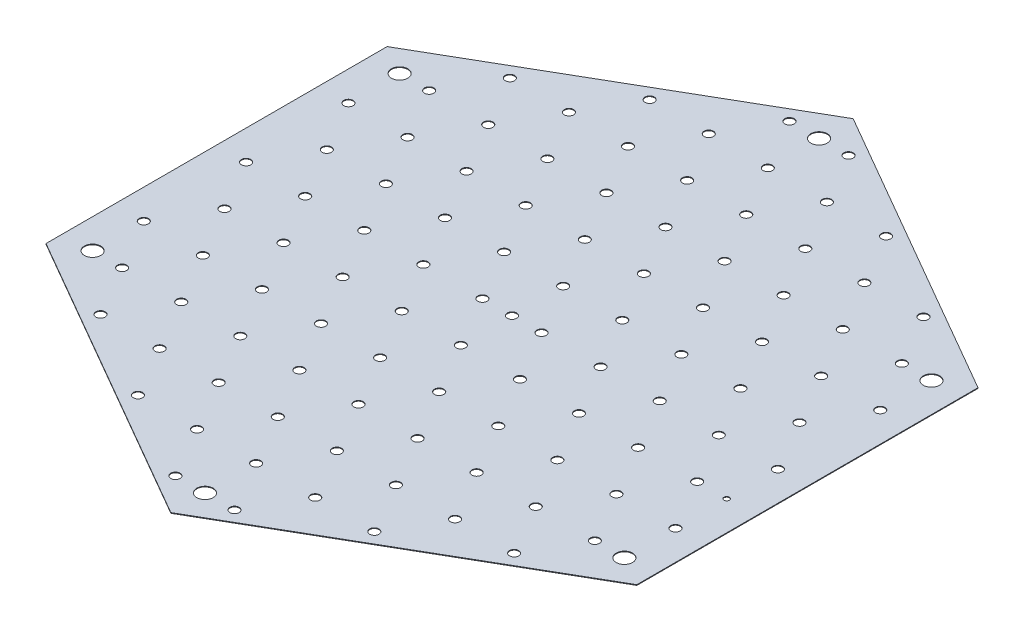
from build123d import *

# Parameters (mm, degrees)
BOSS_EXTRUDE1_DEPTH   = 0.12
SKETCH2_R             = 0.85
CUT_EXTRUDE1_DEPTH    = 83.679815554
BOSS_EXTRUDE2_DEPTH   = 0.12
BOSS_EXTRUDE3_DEPTH   = 0.12
BOSS_EXTRUDE4_DEPTH   = 0.12
SKETCH4_R             = 1.5
CUT_EXTRUDE3_DEPTH    = 83.679815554
SKETCH8_R             = 0.85
CUT_EXTRUDE4_DEPTH    = 83.679815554
SKETCH9_R             = 0.85
CUT_EXTRUDE5_DEPTH    = 83.679815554
SKETCH10_R            = 0.85
CUT_EXTRUDE6_DEPTH    = 83.679815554
SKETCH11_R            = 0.85
CUT_EXTRUDE7_DEPTH    = 83.679815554
SKETCH12_R            = 0.85
CUT_EXTRUDE8_DEPTH    = 83.679815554
SKETCH13_R            = 0.85
CUT_EXTRUDE9_DEPTH    = 83.679815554
SKETCH14_R            = 0.85
CUT_EXTRUDE10_DEPTH   = 83.679815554
SKETCH15_R            = 0.85
CUT_EXTRUDE11_DEPTH   = 83.679815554
SKETCH16_R            = 0.85
CUT_EXTRUDE12_DEPTH   = 83.679815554
SKETCH17_R            = 0.85
CUT_EXTRUDE13_DEPTH   = 83.679815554
LPATTERN3_COUNT       = 5
LPATTERN3_PITCH       = 10.8253
LPATTERN3_COL_COUNT   = 6
LPATTERN3_COL_PITCH   = 10.8253
LPATTERN4_COUNT       = 6
LPATTERN4_PITCH       = 10.8253
LPATTERN4_COL_COUNT   = 5
LPATTERN4_COL_PITCH   = 10.8253
LPATTERN5_COUNT       = 4
LPATTERN5_PITCH       = 10.8253
LPATTERN5_COL_COUNT   = 7
LPATTERN5_COL_PITCH   = 10.8253
LPATTERN6_COUNT       = 3
LPATTERN6_PITCH       = 10.8253
LPATTERN6_COL_COUNT   = 7
LPATTERN6_COL_PITCH   = 10.8253
LPATTERN7_COUNT       = 6
LPATTERN7_PITCH       = 10.8253
LPATTERN8_COUNT       = 5
LPATTERN8_PITCH       = 10.8253
LPATTERN9_COUNT       = 5
LPATTERN9_PITCH       = 10.8253
LPATTERN9_COL_COUNT   = 2
LPATTERN9_COL_PITCH   = 10.8253
LPATTERN10_COUNT      = 4
LPATTERN10_PITCH      = 10.8253
LPATTERN10_COL_COUNT  = 3
LPATTERN10_COL_PITCH  = 10.8253
LPATTERN11_COUNT      = 4
LPATTERN11_PITCH      = 10.8253
LPATTERN11_COL_COUNT  = 3
LPATTERN11_COL_PITCH  = 10.8253
LPATTERN12_COUNT      = 5
LPATTERN12_PITCH      = 10.8253
LPATTERN13_COUNT      = 6
LPATTERN13_PITCH      = 10.8253
LPATTERN14_COUNT      = 6
LPATTERN14_PITCH      = 10.8253
LPATTERN14_COUNT_DIR2 = 5
LPATTERN14_PITCH_DIR2 = 10.8253
LPATTERN15_COUNT      = 7
LPATTERN15_PITCH      = 10.8253
LPATTERN15_COUNT_DIR2 = 4
LPATTERN15_PITCH_DIR2 = 10.8253
LPATTERN16_COUNT      = 7
LPATTERN16_PITCH      = 10.8253
LPATTERN16_COUNT_DIR2 = 3
LPATTERN16_PITCH_DIR2 = 10.8253
LPATTERN17_COUNT      = 6
LPATTERN17_PITCH      = 10.8253
LPATTERN18_COUNT      = 5
LPATTERN18_PITCH      = 10.8253
LPATTERN19_COUNT      = 4
LPATTERN19_PITCH      = 10.8253
LPATTERN20_COUNT      = 3
LPATTERN20_PITCH      = 10.8253
SKETCH18_R            = 0.5
CUT_EXTRUDE14_DEPTH   = 83.679815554


with BuildPart() as part:
    # Sketch1 → Boss-Extrude1 (new body)
    with BuildSketch(Plane(origin=(0, 0, 0), x_dir=(1, 0, 0), z_dir=(0, 1, 0))):
        Polygon((0, 62.5), (-54.126587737, 31.25), (-54.126587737, -31.25), (0, -62.5), (54.126587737, -31.25), (54.126587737, 31.25), align=None)
    extrude(amount=BOSS_EXTRUDE1_DEPTH)

    # Sketch2 → Cut-Extrude1 (cut, through all)
    with BuildSketch(Plane(origin=(0, 0.12, 0), x_dir=(1, 0, 0), z_dir=(0, 1, 0))):
        with Locations(Location((0, 0, 0), (0, 0, 270))):
            Circle(SKETCH2_R)
    extrude(amount=-CUT_EXTRUDE1_DEPTH, mode=Mode.SUBTRACT)

    # Sketch5 → Boss-Extrude2 (add)
    with BuildSketch(Plane(origin=(0, 0.12, 0), x_dir=(1, 0, 0), z_dir=(0, 1, 0))):
        Polygon((-54.126587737, 26.862137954), (3.8, 60.306068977), (0, 62.5), (-54.126587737, 31.25), align=None)
    extrude(amount=-BOSS_EXTRUDE2_DEPTH)

    # Sketch6 → Boss-Extrude3 (add)
    with BuildSketch(Plane(origin=(0, 0.12, 0), x_dir=(1, 0, 0), z_dir=(0, 1, 0))):
        Polygon((54.126587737, 31.25), (54.126587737, 26.862137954), (-3.8, 60.306068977), (0, 62.5), align=None)
    extrude(amount=-BOSS_EXTRUDE3_DEPTH)

    # Sketch7 → Boss-Extrude4 (add)
    with BuildSketch(Plane(origin=(0, 0.12, 0), x_dir=(1, 0, 0), z_dir=(0, 1, 0))):
        Polygon((-54.126587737, -31.25), (-54.126587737, -26.862137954), (0, -58.112137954), (54.126587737, -26.862137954), (54.126587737, -31.25), (0, -62.5), align=None)
    extrude(amount=-BOSS_EXTRUDE4_DEPTH)

    # Sketch4 → Cut-Extrude3 (cut, through all)
    with BuildSketch(Plane(origin=(0, 0.12, 0), x_dir=(1, 0, 0), z_dir=(0, 1, 0))):
        with Locations(Location((0, 56.253070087, 0), (0, 0, 270))):
            Circle(SKETCH4_R)
        with Locations(Location((-48.713928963, 28.125, 0), (0, 0, 270))):
            Circle(SKETCH4_R)
        with Locations(Location((-48.716587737, -28.126535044, 0), (0, 0, 270))):
            Circle(SKETCH4_R)
        with Locations(Location((0, -56.253070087, 0), (0, 0, 270))):
            Circle(SKETCH4_R)
        with Locations(Location((48.716587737, -28.126535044, 0), (0, 0, 270))):
            Circle(SKETCH4_R)
        with Locations(Location((48.716587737, 28.126535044, 0), (0, 0, 270))):
            Circle(SKETCH4_R)
    extrude(amount=-CUT_EXTRUDE3_DEPTH, mode=Mode.SUBTRACT)

    # Sketch8 → Cut-Extrude4 (cut, through all)
    with BuildSketch(Plane(origin=(0, 0.12, 0), x_dir=(1, 0, 0), z_dir=(0, 1, 0))):
        with Locations(Location((5.41265, 0, 0), (0, 0, 270))):
            Circle(SKETCH8_R)
    cut_extrude4 = extrude(amount=-CUT_EXTRUDE4_DEPTH, mode=Mode.SUBTRACT)

    # Sketch9 → Cut-Extrude5 (cut, through all)
    with BuildSketch(Plane(origin=(0, 0.12, 0), x_dir=(1, 0, 0), z_dir=(0, 1, 0))):
        with Locations(Location((16.23795, 0, 0), (0, 0, 270))):
            Circle(SKETCH9_R)
    cut_extrude5 = extrude(amount=-CUT_EXTRUDE5_DEPTH, mode=Mode.SUBTRACT)

    # Sketch10 → Cut-Extrude6 (cut, through all)
    with BuildSketch(Plane(origin=(0, 0.12, 0), x_dir=(1, 0, 0), z_dir=(0, 1, 0))):
        with Locations(Location((27.06325, 0, 0), (0, 0, 270))):
            Circle(SKETCH10_R)
    cut_extrude6 = extrude(amount=-CUT_EXTRUDE6_DEPTH, mode=Mode.SUBTRACT)

    # Sketch11 → Cut-Extrude7 (cut, through all)
    with BuildSketch(Plane(origin=(0, 0.12, 0), x_dir=(1, 0, 0), z_dir=(0, 1, 0))):
        with Locations(Location((37.88855, 0, 0), (0, 0, 270))):
            Circle(SKETCH11_R)
    cut_extrude7 = extrude(amount=-CUT_EXTRUDE7_DEPTH, mode=Mode.SUBTRACT)

    # Sketch12 → Cut-Extrude8 (cut, through all)
    with BuildSketch(Plane(origin=(0, 0.12, 0), x_dir=(1, 0, 0), z_dir=(0, 1, 0))):
        with Locations(Location((48.71385, 0, 0), (0, 0, 270))):
            Circle(SKETCH12_R)
    cut_extrude8 = extrude(amount=-CUT_EXTRUDE8_DEPTH, mode=Mode.SUBTRACT)

    # Sketch13 → Cut-Extrude9 (cut, through all)
    with BuildSketch(Plane(origin=(0, 0.12, 0), x_dir=(1, 0, 0), z_dir=(0, 1, 0))):
        with Locations(Location((-5.41265, 0, 0), (0, 0, 270))):
            Circle(SKETCH13_R)
    cut_extrude9 = extrude(amount=-CUT_EXTRUDE9_DEPTH, mode=Mode.SUBTRACT)

    # Sketch14 → Cut-Extrude10 (cut, through all)
    with BuildSketch(Plane(origin=(0, 0.12, 0), x_dir=(1, 0, 0), z_dir=(0, 1, 0))):
        with Locations(Location((-16.23795, 0, 0), (0, 0, 270))):
            Circle(SKETCH14_R)
    cut_extrude10 = extrude(amount=-CUT_EXTRUDE10_DEPTH, mode=Mode.SUBTRACT)

    # Sketch15 → Cut-Extrude11 (cut, through all)
    with BuildSketch(Plane(origin=(0, 0.12, 0), x_dir=(1, 0, 0), z_dir=(0, 1, 0))):
        with Locations(Location((-27.06325, 0, 0), (0, 0, 270))):
            Circle(SKETCH15_R)
    cut_extrude11 = extrude(amount=-CUT_EXTRUDE11_DEPTH, mode=Mode.SUBTRACT)

    # Sketch16 → Cut-Extrude12 (cut, through all)
    with BuildSketch(Plane(origin=(0, 0.12, 0), x_dir=(1, 0, 0), z_dir=(0, 1, 0))):
        with Locations(Location((-37.88855, 0, 0), (0, 0, 270))):
            Circle(SKETCH16_R)
    cut_extrude12 = extrude(amount=-CUT_EXTRUDE12_DEPTH, mode=Mode.SUBTRACT)

    # Sketch17 → Cut-Extrude13 (cut, through all)
    with BuildSketch(Plane(origin=(0, 0.12, 0), x_dir=(1, 0, 0), z_dir=(0, 1, 0))):
        with Locations(Location((-48.71385, 0, 0), (0, 0, 270))):
            Circle(SKETCH17_R)
    cut_extrude13 = extrude(amount=-CUT_EXTRUDE13_DEPTH, mode=Mode.SUBTRACT)

    # LPattern3: Cut-Extrude4 ×5
    with Locations(*[Vector(0.4999999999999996, 0, 0.8660254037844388) * (i * LPATTERN3_PITCH) for i in range(1, LPATTERN3_COUNT)]):
        add(cut_extrude4, mode=Mode.SUBTRACT)

    # LPattern3 col: Cut-Extrude4 ×6
    with Locations(*[Vector(-0.4999999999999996, 0, -0.8660254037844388) * (i * LPATTERN3_COL_PITCH) for i in range(1, LPATTERN3_COL_COUNT)]):
        add(cut_extrude4, mode=Mode.SUBTRACT)

    # LPattern4: Cut-Extrude5 ×6
    with Locations(*[Vector(-0.4999999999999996, 0, -0.8660254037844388) * (i * LPATTERN4_PITCH) for i in range(1, LPATTERN4_COUNT)]):
        add(cut_extrude5, mode=Mode.SUBTRACT)

    # LPattern4 col: Cut-Extrude5 ×5
    with Locations(*[Vector(0.4999999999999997, 0, 0.8660254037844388) * (i * LPATTERN4_COL_PITCH) for i in range(1, LPATTERN4_COL_COUNT)]):
        add(cut_extrude5, mode=Mode.SUBTRACT)

    # LPattern5: Cut-Extrude6 ×4
    with Locations(*[Vector(0.4999999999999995, 0, 0.8660254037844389) * (i * LPATTERN5_PITCH) for i in range(1, LPATTERN5_COUNT)]):
        add(cut_extrude6, mode=Mode.SUBTRACT)

    # LPattern5 col: Cut-Extrude6 ×7
    with Locations(*[Vector(-0.4999999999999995, 0, -0.8660254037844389) * (i * LPATTERN5_COL_PITCH) for i in range(1, LPATTERN5_COL_COUNT)]):
        add(cut_extrude6, mode=Mode.SUBTRACT)

    # LPattern6: Cut-Extrude7 ×3
    with Locations(*[Vector(0.4999999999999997, 0, 0.8660254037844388) * (i * LPATTERN6_PITCH) for i in range(1, LPATTERN6_COUNT)]):
        add(cut_extrude7, mode=Mode.SUBTRACT)

    # LPattern6 col: Cut-Extrude7 ×7
    with Locations(*[Vector(-0.4999999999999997, 0, -0.8660254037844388) * (i * LPATTERN6_COL_PITCH) for i in range(1, LPATTERN6_COL_COUNT)]):
        add(cut_extrude7, mode=Mode.SUBTRACT)

    # LPattern7: Cut-Extrude8 ×6
    with Locations(*[Vector(-0.4999999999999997, 0, -0.8660254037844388) * (i * LPATTERN7_PITCH) for i in range(1, LPATTERN7_COUNT)]):
        add(cut_extrude8, mode=Mode.SUBTRACT)

    # LPattern8: Cut-Extrude9 ×5
    with Locations(*[Vector(-0.4999999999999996, 0, 0.8660254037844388) * (i * LPATTERN8_PITCH) for i in range(1, LPATTERN8_COUNT)]):
        add(cut_extrude9, mode=Mode.SUBTRACT)

    # LPattern9: Cut-Extrude10 ×5
    with Locations(*[Vector(-0.4999999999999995, 0, 0.8660254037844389) * (i * LPATTERN9_PITCH) for i in range(1, LPATTERN9_COUNT)]):
        add(cut_extrude10, mode=Mode.SUBTRACT)

    # LPattern9 col: Cut-Extrude10 ×2
    with Locations(*[Vector(0.4999999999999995, 0, -0.8660254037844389) * (i * LPATTERN9_COL_PITCH) for i in range(1, LPATTERN9_COL_COUNT)]):
        add(cut_extrude10, mode=Mode.SUBTRACT)

    # LPattern10: Cut-Extrude11 ×4
    with Locations(*[Vector(-0.4999999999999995, 0, 0.8660254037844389) * (i * LPATTERN10_PITCH) for i in range(1, LPATTERN10_COUNT)]):
        add(cut_extrude11, mode=Mode.SUBTRACT)

    # LPattern10 col: Cut-Extrude11 ×3
    with Locations(*[Vector(0.4999999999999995, 0, -0.8660254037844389) * (i * LPATTERN10_COL_PITCH) for i in range(1, LPATTERN10_COL_COUNT)]):
        add(cut_extrude11, mode=Mode.SUBTRACT)

    # LPattern11: Cut-Extrude12 ×4
    with Locations(*[Vector(0.4999999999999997, 0, -0.8660254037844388) * (i * LPATTERN11_PITCH) for i in range(1, LPATTERN11_COUNT)]):
        add(cut_extrude12, mode=Mode.SUBTRACT)

    # LPattern11 col: Cut-Extrude12 ×3
    with Locations(*[Vector(-0.4999999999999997, 0, 0.8660254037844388) * (i * LPATTERN11_COL_PITCH) for i in range(1, LPATTERN11_COL_COUNT)]):
        add(cut_extrude12, mode=Mode.SUBTRACT)

    # LPattern12: Cut-Extrude13 ×5
    with Locations(*[Vector(0.4999999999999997, 0, -0.8660254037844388) * (i * LPATTERN12_PITCH) for i in range(1, LPATTERN12_COUNT)]):
        add(cut_extrude13, mode=Mode.SUBTRACT)

    # LPattern13: Cut-Extrude9 ×6
    with Locations(*[Vector(0.4999999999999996, 0, 0.8660254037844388) * (i * LPATTERN13_PITCH) for i in range(1, LPATTERN13_COUNT)]):
        add(cut_extrude9, mode=Mode.SUBTRACT)

    # LPattern14: Cut-Extrude10 6 × 5
    with Locations(*[Vector(0.4999999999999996, 0, 0.8660254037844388) * (i * LPATTERN14_PITCH) + Vector(-0.4999999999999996, 0, -0.8660254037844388) * (j * LPATTERN14_PITCH_DIR2) for i in range(LPATTERN14_COUNT) for j in range(LPATTERN14_COUNT_DIR2) if (i, j) != (0, 0)]):
        add(cut_extrude10, mode=Mode.SUBTRACT)

    # LPattern15: Cut-Extrude11 7 × 4
    with Locations(*[Vector(0.4999999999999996, 0, 0.8660254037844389) * (i * LPATTERN15_PITCH) + Vector(-0.4999999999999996, 0, -0.8660254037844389) * (j * LPATTERN15_PITCH_DIR2) for i in range(LPATTERN15_COUNT) for j in range(LPATTERN15_COUNT_DIR2) if (i, j) != (0, 0)]):
        add(cut_extrude11, mode=Mode.SUBTRACT)

    # LPattern16: Cut-Extrude12 7 × 3
    with Locations(*[Vector(0.4999999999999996, 0, 0.8660254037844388) * (i * LPATTERN16_PITCH) + Vector(-0.4999999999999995, 0, -0.8660254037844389) * (j * LPATTERN16_PITCH_DIR2) for i in range(LPATTERN16_COUNT) for j in range(LPATTERN16_COUNT_DIR2) if (i, j) != (0, 0)]):
        add(cut_extrude12, mode=Mode.SUBTRACT)

    # LPattern17: Cut-Extrude13 ×6
    with Locations(*[Vector(0.49999999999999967, 0, 0.8660254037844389) * (i * LPATTERN17_PITCH) for i in range(1, LPATTERN17_COUNT)]):
        add(cut_extrude13, mode=Mode.SUBTRACT)

    # LPattern18: Cut-Extrude5 ×5
    with Locations(*[Vector(0.4999999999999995, 0, -0.8660254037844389) * (i * LPATTERN18_PITCH) for i in range(1, LPATTERN18_COUNT)]):
        add(cut_extrude5, mode=Mode.SUBTRACT)

    # LPattern19: Cut-Extrude6 ×4
    with Locations(*[Vector(0.4999999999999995, 0, -0.866025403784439) * (i * LPATTERN19_PITCH) for i in range(1, LPATTERN19_COUNT)]):
        add(cut_extrude6, mode=Mode.SUBTRACT)

    # LPattern20: Cut-Extrude7 ×3
    with Locations(*[Vector(0.4999999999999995, 0, -0.8660254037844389) * (i * LPATTERN20_PITCH) for i in range(1, LPATTERN20_COUNT)]):
        add(cut_extrude7, mode=Mode.SUBTRACT)

    # Sketch18 → Cut-Extrude14 (cut, through all)
    with BuildSketch(Plane(origin=(0, 0.12, 0), x_dir=(1, 0, 0), z_dir=(0, 1, 0))):
        with Locations(Location((48.71385, -9.374984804, 0), (0, 0, 270))):
            Circle(SKETCH18_R)
    extrude(amount=-CUT_EXTRUDE14_DEPTH, mode=Mode.SUBTRACT)


solid = part.part
